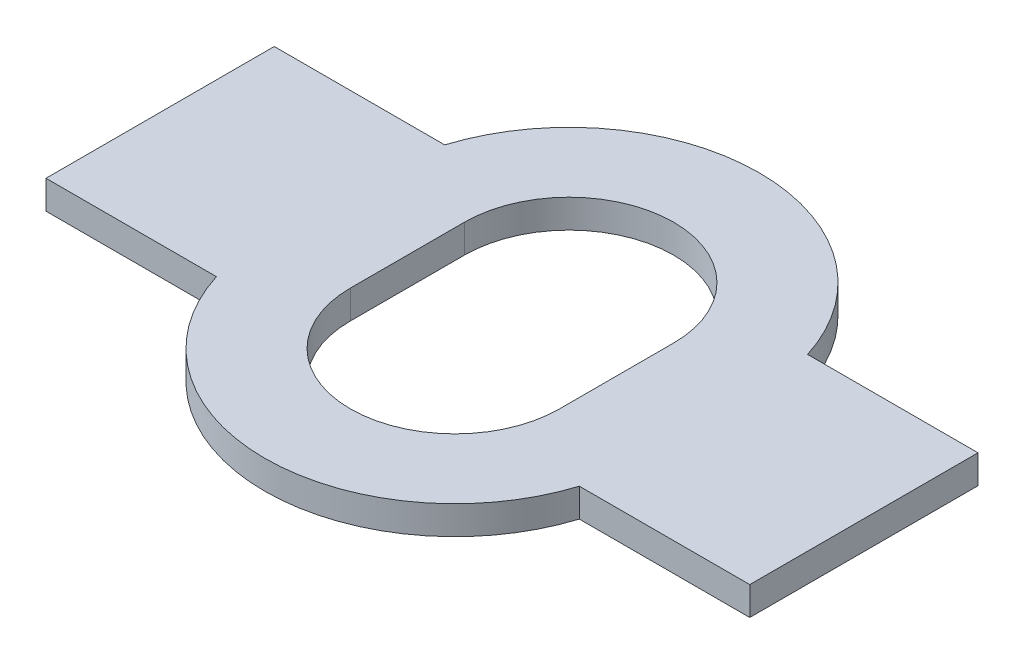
ISO-10303-21;
HEADER;
FILE_DESCRIPTION(('STEP AP214'),'2;1');
FILE_NAME('part.step','',(''),(''),'','','');
FILE_SCHEMA(('AUTOMOTIVE_DESIGN { 1 0 10303 214 1 1 1 1 }'));
ENDSEC;
DATA;
#1=APPLICATION_CONTEXT('core data for automotive mechanical design processes');
#2=APPLICATION_PROTOCOL_DEFINITION('international standard','automotive_design',2000,#1);
#3=PRODUCT_CONTEXT('',#1,'mechanical');
#4=PRODUCT('Part','Part','',(#3));
#5=PRODUCT_RELATED_PRODUCT_CATEGORY('part','',(#4));
#6=PRODUCT_DEFINITION_FORMATION('','',#4);
#7=PRODUCT_DEFINITION_CONTEXT('part definition',#1,'design');
#8=PRODUCT_DEFINITION('design','',#6,#7);
#9=PRODUCT_DEFINITION_SHAPE('','',#8);
#10=(LENGTH_UNIT() NAMED_UNIT(*) SI_UNIT(.MILLI.,.METRE.));
#11=(NAMED_UNIT(*) PLANE_ANGLE_UNIT() SI_UNIT($,.RADIAN.));
#12=(NAMED_UNIT(*) SI_UNIT($,.STERADIAN.) SOLID_ANGLE_UNIT());
#13=UNCERTAINTY_MEASURE_WITH_UNIT(LENGTH_MEASURE(1.E-05),#10,'distance_accuracy_value','');
#14=(GEOMETRIC_REPRESENTATION_CONTEXT(3) GLOBAL_UNCERTAINTY_ASSIGNED_CONTEXT((#13)) GLOBAL_UNIT_ASSIGNED_CONTEXT((#10,
#11,#12)) REPRESENTATION_CONTEXT('',''));
#15=CARTESIAN_POINT('',(0.,0.,0.));
#16=DIRECTION('',(0.,0.,1.));
#17=DIRECTION('',(1.,0.,0.));
#18=AXIS2_PLACEMENT_3D('',#15,#16,#17);
#19=CARTESIAN_POINT('',(0.,3.,-6.00000000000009));
#20=DIRECTION('',(0.,1.,0.));
#21=DIRECTION('',(0.,0.,1.));
#22=AXIS2_PLACEMENT_3D('',#19,#20,#21);
#23=PLANE('',#22);
#24=DIRECTION('',(0.,0.,-1.));
#25=VECTOR('',#24,1.);
#26=CARTESIAN_POINT('',(37.,3.,12.));
#27=LINE('',#26,#25);
#28=CARTESIAN_POINT('',(37.,3.,12.));
#29=VERTEX_POINT('',#28);
#30=CARTESIAN_POINT('',(37.,3.,-12.0000000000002));
#31=VERTEX_POINT('',#30);
#32=EDGE_CURVE('E156',#29,#31,#27,.T.);
#33=ORIENTED_EDGE('',*,*,#32,.T.);
#34=DIRECTION('',(-1.,0.,0.));
#35=VECTOR('',#34,1.);
#36=CARTESIAN_POINT('',(37.,3.,-12.0000000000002));
#37=LINE('',#36,#35);
#38=CARTESIAN_POINT('',(19.0787840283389,3.,-12.));
#39=VERTEX_POINT('',#38);
#40=EDGE_CURVE('E159',#31,#39,#37,.T.);
#41=ORIENTED_EDGE('',*,*,#40,.T.);
#42=CARTESIAN_POINT('',(0.,3.,-6.00000000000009));
#43=DIRECTION('',(0.,1.,0.));
#44=DIRECTION('',(0.,0.,1.));
#45=AXIS2_PLACEMENT_3D('',#42,#43,#44);
#46=CIRCLE('',#45,20.);
#47=CARTESIAN_POINT('',(-19.0787840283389,3.,-12.));
#48=VERTEX_POINT('',#47);
#49=EDGE_CURVE('E162',#39,#48,#46,.T.);
#50=ORIENTED_EDGE('',*,*,#49,.T.);
#51=DIRECTION('',(-1.,0.,0.));
#52=VECTOR('',#51,1.);
#53=CARTESIAN_POINT('',(-19.0787840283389,3.,-12.));
#54=LINE('',#53,#52);
#55=CARTESIAN_POINT('',(-37.,3.,-12.0000000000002));
#56=VERTEX_POINT('',#55);
#57=EDGE_CURVE('E164',#48,#56,#54,.T.);
#58=ORIENTED_EDGE('',*,*,#57,.T.);
#59=DIRECTION('',(0.,0.,1.));
#60=VECTOR('',#59,1.);
#61=CARTESIAN_POINT('',(-37.,3.,12.));
#62=LINE('',#61,#60);
#63=CARTESIAN_POINT('',(-37.,3.,12.));
#64=VERTEX_POINT('',#63);
#65=EDGE_CURVE('E166',#56,#64,#62,.T.);
#66=ORIENTED_EDGE('',*,*,#65,.T.);
#67=DIRECTION('',(1.,0.,0.));
#68=VECTOR('',#67,1.);
#69=CARTESIAN_POINT('',(-37.,3.,12.));
#70=LINE('',#69,#68);
#71=CARTESIAN_POINT('',(-19.0787840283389,3.,12.));
#72=VERTEX_POINT('',#71);
#73=EDGE_CURVE('E168',#64,#72,#70,.T.);
#74=ORIENTED_EDGE('',*,*,#73,.T.);
#75=CARTESIAN_POINT('',(0.,3.,5.99999999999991));
#76=DIRECTION('',(0.,1.,0.));
#77=DIRECTION('',(0.,0.,1.));
#78=AXIS2_PLACEMENT_3D('',#75,#76,#77);
#79=CIRCLE('',#78,20.);
#80=CARTESIAN_POINT('',(19.0787840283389,3.,12.));
#81=VERTEX_POINT('',#80);
#82=EDGE_CURVE('E170',#72,#81,#79,.T.);
#83=ORIENTED_EDGE('',*,*,#82,.T.);
#84=DIRECTION('',(1.,0.,0.));
#85=VECTOR('',#84,1.);
#86=CARTESIAN_POINT('',(19.0787840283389,3.,12.));
#87=LINE('',#86,#85);
#88=EDGE_CURVE('E172',#81,#29,#87,.T.);
#89=ORIENTED_EDGE('',*,*,#88,.T.);
#90=EDGE_LOOP('',(#33,#41,#50,#58,#66,#74,#83,#89));
#91=FACE_BOUND('',#90,.T.);
#92=DIRECTION('',(0.,0.,1.));
#93=VECTOR('',#92,1.);
#94=CARTESIAN_POINT('',(-11.,3.,-6.00000000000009));
#95=LINE('',#94,#93);
#96=CARTESIAN_POINT('',(-11.,3.,-6.00000000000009));
#97=VERTEX_POINT('',#96);
#98=CARTESIAN_POINT('',(-11.,3.,5.99999999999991));
#99=VERTEX_POINT('',#98);
#100=EDGE_CURVE('E128',#97,#99,#95,.T.);
#101=ORIENTED_EDGE('',*,*,#100,.F.);
#102=CARTESIAN_POINT('',(0.,3.,-6.00000000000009));
#103=DIRECTION('',(0.,1.,0.));
#104=DIRECTION('',(0.,0.,1.));
#105=AXIS2_PLACEMENT_3D('',#102,#103,#104);
#106=CIRCLE('',#105,11.);
#107=CARTESIAN_POINT('',(11.,3.,-6.00000000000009));
#108=VERTEX_POINT('',#107);
#109=EDGE_CURVE('E120',#108,#97,#106,.T.);
#110=ORIENTED_EDGE('',*,*,#109,.F.);
#111=DIRECTION('',(0.,0.,-1.));
#112=VECTOR('',#111,1.);
#113=CARTESIAN_POINT('',(11.,3.,-6.00000000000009));
#114=LINE('',#113,#112);
#115=CARTESIAN_POINT('',(11.,3.,5.99999999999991));
#116=VERTEX_POINT('',#115);
#117=EDGE_CURVE('E142',#116,#108,#114,.T.);
#118=ORIENTED_EDGE('',*,*,#117,.F.);
#119=CARTESIAN_POINT('',(0.,3.,5.99999999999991));
#120=DIRECTION('',(0.,1.,0.));
#121=DIRECTION('',(0.,0.,1.));
#122=AXIS2_PLACEMENT_3D('',#119,#120,#121);
#123=CIRCLE('',#122,11.);
#124=EDGE_CURVE('E140',#99,#116,#123,.T.);
#125=ORIENTED_EDGE('',*,*,#124,.F.);
#126=EDGE_LOOP('',(#101,#110,#118,#125));
#127=FACE_BOUND('',#126,.T.);
#128=ADVANCED_FACE('F31',(#91,#127),#23,.T.);
#129=CARTESIAN_POINT('',(0.,0.,-6.00000000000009));
#130=DIRECTION('',(0.,1.,0.));
#131=DIRECTION('',(0.,0.,1.));
#132=AXIS2_PLACEMENT_3D('',#129,#130,#131);
#133=PLANE('',#132);
#134=DIRECTION('',(0.,0.,-1.));
#135=VECTOR('',#134,1.);
#136=CARTESIAN_POINT('',(37.,0.,12.));
#137=LINE('',#136,#135);
#138=CARTESIAN_POINT('',(37.,0.,12.));
#139=VERTEX_POINT('',#138);
#140=CARTESIAN_POINT('',(37.,0.,-12.0000000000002));
#141=VERTEX_POINT('',#140);
#142=EDGE_CURVE('E136',#139,#141,#137,.T.);
#143=ORIENTED_EDGE('',*,*,#142,.F.);
#144=DIRECTION('',(1.,0.,0.));
#145=VECTOR('',#144,1.);
#146=CARTESIAN_POINT('',(19.0787840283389,0.,12.));
#147=LINE('',#146,#145);
#148=CARTESIAN_POINT('',(19.0787840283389,0.,12.));
#149=VERTEX_POINT('',#148);
#150=EDGE_CURVE('E160',#149,#139,#147,.T.);
#151=ORIENTED_EDGE('',*,*,#150,.F.);
#152=CARTESIAN_POINT('',(0.,0.,5.99999999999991));
#153=DIRECTION('',(0.,1.,0.));
#154=DIRECTION('',(0.,0.,1.));
#155=AXIS2_PLACEMENT_3D('',#152,#153,#154);
#156=CIRCLE('',#155,20.);
#157=CARTESIAN_POINT('',(-19.0787840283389,0.,12.));
#158=VERTEX_POINT('',#157);
#159=EDGE_CURVE('E187',#158,#149,#156,.T.);
#160=ORIENTED_EDGE('',*,*,#159,.F.);
#161=DIRECTION('',(1.,0.,0.));
#162=VECTOR('',#161,1.);
#163=CARTESIAN_POINT('',(-37.,0.,12.));
#164=LINE('',#163,#162);
#165=CARTESIAN_POINT('',(-37.,0.,12.));
#166=VERTEX_POINT('',#165);
#167=EDGE_CURVE('E185',#166,#158,#164,.T.);
#168=ORIENTED_EDGE('',*,*,#167,.F.);
#169=DIRECTION('',(0.,0.,1.));
#170=VECTOR('',#169,1.);
#171=CARTESIAN_POINT('',(-37.,0.,12.));
#172=LINE('',#171,#170);
#173=CARTESIAN_POINT('',(-37.,0.,-12.0000000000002));
#174=VERTEX_POINT('',#173);
#175=EDGE_CURVE('E183',#174,#166,#172,.T.);
#176=ORIENTED_EDGE('',*,*,#175,.F.);
#177=DIRECTION('',(-1.,0.,0.));
#178=VECTOR('',#177,1.);
#179=CARTESIAN_POINT('',(-19.0787840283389,0.,-12.));
#180=LINE('',#179,#178);
#181=CARTESIAN_POINT('',(-19.0787840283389,0.,-12.));
#182=VERTEX_POINT('',#181);
#183=EDGE_CURVE('E181',#182,#174,#180,.T.);
#184=ORIENTED_EDGE('',*,*,#183,.F.);
#185=CARTESIAN_POINT('',(0.,0.,-6.00000000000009));
#186=DIRECTION('',(0.,1.,0.));
#187=DIRECTION('',(0.,0.,1.));
#188=AXIS2_PLACEMENT_3D('',#185,#186,#187);
#189=CIRCLE('',#188,20.);
#190=CARTESIAN_POINT('',(19.0787840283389,0.,-12.));
#191=VERTEX_POINT('',#190);
#192=EDGE_CURVE('E179',#191,#182,#189,.T.);
#193=ORIENTED_EDGE('',*,*,#192,.F.);
#194=DIRECTION('',(-1.,0.,0.));
#195=VECTOR('',#194,1.);
#196=CARTESIAN_POINT('',(37.,0.,-12.0000000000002));
#197=LINE('',#196,#195);
#198=EDGE_CURVE('E177',#141,#191,#197,.T.);
#199=ORIENTED_EDGE('',*,*,#198,.F.);
#200=EDGE_LOOP('',(#143,#151,#160,#168,#176,#184,#193,#199));
#201=FACE_BOUND('',#200,.T.);
#202=CARTESIAN_POINT('',(0.,0.,-6.00000000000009));
#203=DIRECTION('',(0.,1.,0.));
#204=DIRECTION('',(0.,0.,1.));
#205=AXIS2_PLACEMENT_3D('',#202,#203,#204);
#206=CIRCLE('',#205,11.);
#207=CARTESIAN_POINT('',(11.,0.,-6.00000000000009));
#208=VERTEX_POINT('',#207);
#209=CARTESIAN_POINT('',(-11.,0.,-6.00000000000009));
#210=VERTEX_POINT('',#209);
#211=EDGE_CURVE('E54',#208,#210,#206,.T.);
#212=ORIENTED_EDGE('',*,*,#211,.T.);
#213=DIRECTION('',(0.,0.,1.));
#214=VECTOR('',#213,1.);
#215=CARTESIAN_POINT('',(-11.,0.,-6.00000000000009));
#216=LINE('',#215,#214);
#217=CARTESIAN_POINT('',(-11.,0.,5.99999999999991));
#218=VERTEX_POINT('',#217);
#219=EDGE_CURVE('E135',#210,#218,#216,.T.);
#220=ORIENTED_EDGE('',*,*,#219,.T.);
#221=CARTESIAN_POINT('',(0.,0.,5.99999999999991));
#222=DIRECTION('',(0.,1.,0.));
#223=DIRECTION('',(0.,0.,1.));
#224=AXIS2_PLACEMENT_3D('',#221,#222,#223);
#225=CIRCLE('',#224,11.);
#226=CARTESIAN_POINT('',(11.,0.,5.99999999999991));
#227=VERTEX_POINT('',#226);
#228=EDGE_CURVE('E148',#218,#227,#225,.T.);
#229=ORIENTED_EDGE('',*,*,#228,.T.);
#230=DIRECTION('',(0.,0.,-1.));
#231=VECTOR('',#230,1.);
#232=CARTESIAN_POINT('',(11.,0.,-6.00000000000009));
#233=LINE('',#232,#231);
#234=EDGE_CURVE('E129',#227,#208,#233,.T.);
#235=ORIENTED_EDGE('',*,*,#234,.T.);
#236=EDGE_LOOP('',(#212,#220,#229,#235));
#237=FACE_BOUND('',#236,.T.);
#238=ADVANCED_FACE('F217',(#201,#237),#133,.F.);
#239=CARTESIAN_POINT('',(37.,3.,12.));
#240=DIRECTION('',(-1.,0.,0.));
#241=DIRECTION('',(0.,0.,1.));
#242=AXIS2_PLACEMENT_3D('',#239,#240,#241);
#243=PLANE('',#242);
#244=ORIENTED_EDGE('',*,*,#142,.T.);
#245=DIRECTION('',(0.,-1.,0.));
#246=VECTOR('',#245,1.);
#247=CARTESIAN_POINT('',(37.,3.,-12.0000000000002));
#248=LINE('',#247,#246);
#249=EDGE_CURVE('E11',#31,#141,#248,.T.);
#250=ORIENTED_EDGE('',*,*,#249,.F.);
#251=ORIENTED_EDGE('',*,*,#32,.F.);
#252=DIRECTION('',(0.,-1.,0.));
#253=VECTOR('',#252,1.);
#254=CARTESIAN_POINT('',(37.,3.,12.));
#255=LINE('',#254,#253);
#256=EDGE_CURVE('E174',#29,#139,#255,.T.);
#257=ORIENTED_EDGE('',*,*,#256,.T.);
#258=EDGE_LOOP('',(#244,#250,#251,#257));
#259=FACE_BOUND('',#258,.T.);
#260=ADVANCED_FACE('F33',(#259),#243,.F.);
#261=CARTESIAN_POINT('',(37.,3.,-12.0000000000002));
#262=DIRECTION('',(0.,0.,1.));
#263=DIRECTION('',(1.,0.,0.));
#264=AXIS2_PLACEMENT_3D('',#261,#262,#263);
#265=PLANE('',#264);
#266=ORIENTED_EDGE('',*,*,#198,.T.);
#267=DIRECTION('',(0.,-1.,0.));
#268=VECTOR('',#267,1.);
#269=CARTESIAN_POINT('',(19.0787840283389,3.,-12.));
#270=LINE('',#269,#268);
#271=EDGE_CURVE('E39',#39,#191,#270,.T.);
#272=ORIENTED_EDGE('',*,*,#271,.F.);
#273=ORIENTED_EDGE('',*,*,#40,.F.);
#274=ORIENTED_EDGE('',*,*,#249,.T.);
#275=EDGE_LOOP('',(#266,#272,#273,#274));
#276=FACE_BOUND('',#275,.T.);
#277=ADVANCED_FACE('F234',(#276),#265,.F.);
#278=CARTESIAN_POINT('',(0.,3.,-6.00000000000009));
#279=DIRECTION('',(0.,-1.,0.));
#280=DIRECTION('',(0.,0.,-1.));
#281=AXIS2_PLACEMENT_3D('',#278,#279,#280);
#282=CYLINDRICAL_SURFACE('',#281,20.);
#283=ORIENTED_EDGE('',*,*,#192,.T.);
#284=DIRECTION('',(0.,-1.,0.));
#285=VECTOR('',#284,1.);
#286=CARTESIAN_POINT('',(-19.0787840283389,3.,-12.));
#287=LINE('',#286,#285);
#288=EDGE_CURVE('E204',#48,#182,#287,.T.);
#289=ORIENTED_EDGE('',*,*,#288,.F.);
#290=ORIENTED_EDGE('',*,*,#49,.F.);
#291=ORIENTED_EDGE('',*,*,#271,.T.);
#292=EDGE_LOOP('',(#283,#289,#290,#291));
#293=FACE_BOUND('',#292,.T.);
#294=ADVANCED_FACE('F211',(#293),#282,.T.);
#295=CARTESIAN_POINT('',(-19.0787840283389,3.,-12.));
#296=DIRECTION('',(0.,0.,1.));
#297=DIRECTION('',(1.,0.,0.));
#298=AXIS2_PLACEMENT_3D('',#295,#296,#297);
#299=PLANE('',#298);
#300=ORIENTED_EDGE('',*,*,#183,.T.);
#301=DIRECTION('',(0.,-1.,0.));
#302=VECTOR('',#301,1.);
#303=CARTESIAN_POINT('',(-37.,3.,-12.0000000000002));
#304=LINE('',#303,#302);
#305=EDGE_CURVE('E201',#56,#174,#304,.T.);
#306=ORIENTED_EDGE('',*,*,#305,.F.);
#307=ORIENTED_EDGE('',*,*,#57,.F.);
#308=ORIENTED_EDGE('',*,*,#288,.T.);
#309=EDGE_LOOP('',(#300,#306,#307,#308));
#310=FACE_BOUND('',#309,.T.);
#311=ADVANCED_FACE('F223',(#310),#299,.F.);
#312=CARTESIAN_POINT('',(-37.,3.,12.));
#313=DIRECTION('',(1.,0.,0.));
#314=DIRECTION('',(0.,0.,-1.));
#315=AXIS2_PLACEMENT_3D('',#312,#313,#314);
#316=PLANE('',#315);
#317=ORIENTED_EDGE('',*,*,#175,.T.);
#318=DIRECTION('',(0.,-1.,0.));
#319=VECTOR('',#318,1.);
#320=CARTESIAN_POINT('',(-37.,3.,12.));
#321=LINE('',#320,#319);
#322=EDGE_CURVE('E198',#64,#166,#321,.T.);
#323=ORIENTED_EDGE('',*,*,#322,.F.);
#324=ORIENTED_EDGE('',*,*,#65,.F.);
#325=ORIENTED_EDGE('',*,*,#305,.T.);
#326=EDGE_LOOP('',(#317,#323,#324,#325));
#327=FACE_BOUND('',#326,.T.);
#328=ADVANCED_FACE('F227',(#327),#316,.F.);
#329=CARTESIAN_POINT('',(-37.,3.,12.));
#330=DIRECTION('',(0.,0.,-1.));
#331=DIRECTION('',(-1.,0.,0.));
#332=AXIS2_PLACEMENT_3D('',#329,#330,#331);
#333=PLANE('',#332);
#334=ORIENTED_EDGE('',*,*,#167,.T.);
#335=DIRECTION('',(0.,-1.,0.));
#336=VECTOR('',#335,1.);
#337=CARTESIAN_POINT('',(-19.0787840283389,3.,12.));
#338=LINE('',#337,#336);
#339=EDGE_CURVE('E195',#72,#158,#338,.T.);
#340=ORIENTED_EDGE('',*,*,#339,.F.);
#341=ORIENTED_EDGE('',*,*,#73,.F.);
#342=ORIENTED_EDGE('',*,*,#322,.T.);
#343=EDGE_LOOP('',(#334,#340,#341,#342));
#344=FACE_BOUND('',#343,.T.);
#345=ADVANCED_FACE('F247',(#344),#333,.F.);
#346=CARTESIAN_POINT('',(0.,3.,5.99999999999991));
#347=DIRECTION('',(0.,-1.,0.));
#348=DIRECTION('',(0.,0.,-1.));
#349=AXIS2_PLACEMENT_3D('',#346,#347,#348);
#350=CYLINDRICAL_SURFACE('',#349,20.);
#351=ORIENTED_EDGE('',*,*,#159,.T.);
#352=DIRECTION('',(0.,-1.,0.));
#353=VECTOR('',#352,1.);
#354=CARTESIAN_POINT('',(19.0787840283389,3.,12.));
#355=LINE('',#354,#353);
#356=EDGE_CURVE('E192',#81,#149,#355,.T.);
#357=ORIENTED_EDGE('',*,*,#356,.F.);
#358=ORIENTED_EDGE('',*,*,#82,.F.);
#359=ORIENTED_EDGE('',*,*,#339,.T.);
#360=EDGE_LOOP('',(#351,#357,#358,#359));
#361=FACE_BOUND('',#360,.T.);
#362=ADVANCED_FACE('F245',(#361),#350,.T.);
#363=CARTESIAN_POINT('',(19.0787840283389,3.,12.));
#364=DIRECTION('',(0.,0.,-1.));
#365=DIRECTION('',(-1.,0.,0.));
#366=AXIS2_PLACEMENT_3D('',#363,#364,#365);
#367=PLANE('',#366);
#368=ORIENTED_EDGE('',*,*,#150,.T.);
#369=ORIENTED_EDGE('',*,*,#256,.F.);
#370=ORIENTED_EDGE('',*,*,#88,.F.);
#371=ORIENTED_EDGE('',*,*,#356,.T.);
#372=EDGE_LOOP('',(#368,#369,#370,#371));
#373=FACE_BOUND('',#372,.T.);
#374=ADVANCED_FACE('F240',(#373),#367,.F.);
#375=CARTESIAN_POINT('',(0.,3.,-6.00000000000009));
#376=DIRECTION('',(0.,-1.,0.));
#377=DIRECTION('',(0.,0.,-1.));
#378=AXIS2_PLACEMENT_3D('',#375,#376,#377);
#379=CYLINDRICAL_SURFACE('',#378,11.);
#380=ORIENTED_EDGE('',*,*,#211,.F.);
#381=DIRECTION('',(0.,-1.,0.));
#382=VECTOR('',#381,1.);
#383=CARTESIAN_POINT('',(11.,3.,-6.00000000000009));
#384=LINE('',#383,#382);
#385=EDGE_CURVE('E124',#108,#208,#384,.T.);
#386=ORIENTED_EDGE('',*,*,#385,.F.);
#387=ORIENTED_EDGE('',*,*,#109,.T.);
#388=DIRECTION('',(0.,-1.,0.));
#389=VECTOR('',#388,1.);
#390=CARTESIAN_POINT('',(-11.,3.,-6.00000000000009));
#391=LINE('',#390,#389);
#392=EDGE_CURVE('E123',#97,#210,#391,.T.);
#393=ORIENTED_EDGE('',*,*,#392,.T.);
#394=EDGE_LOOP('',(#380,#386,#387,#393));
#395=FACE_BOUND('',#394,.T.);
#396=ADVANCED_FACE('F122',(#395),#379,.F.);
#397=CARTESIAN_POINT('',(-11.,3.,-6.00000000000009));
#398=DIRECTION('',(1.,0.,0.));
#399=DIRECTION('',(0.,0.,-1.));
#400=AXIS2_PLACEMENT_3D('',#397,#398,#399);
#401=PLANE('',#400);
#402=ORIENTED_EDGE('',*,*,#219,.F.);
#403=ORIENTED_EDGE('',*,*,#392,.F.);
#404=ORIENTED_EDGE('',*,*,#100,.T.);
#405=DIRECTION('',(0.,-1.,0.));
#406=VECTOR('',#405,1.);
#407=CARTESIAN_POINT('',(-11.,3.,5.99999999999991));
#408=LINE('',#407,#406);
#409=EDGE_CURVE('E137',#99,#218,#408,.T.);
#410=ORIENTED_EDGE('',*,*,#409,.T.);
#411=EDGE_LOOP('',(#402,#403,#404,#410));
#412=FACE_BOUND('',#411,.T.);
#413=ADVANCED_FACE('F132',(#412),#401,.T.);
#414=CARTESIAN_POINT('',(0.,3.,5.99999999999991));
#415=DIRECTION('',(0.,-1.,0.));
#416=DIRECTION('',(0.,0.,-1.));
#417=AXIS2_PLACEMENT_3D('',#414,#415,#416);
#418=CYLINDRICAL_SURFACE('',#417,11.);
#419=ORIENTED_EDGE('',*,*,#228,.F.);
#420=ORIENTED_EDGE('',*,*,#409,.F.);
#421=ORIENTED_EDGE('',*,*,#124,.T.);
#422=DIRECTION('',(0.,-1.,0.));
#423=VECTOR('',#422,1.);
#424=CARTESIAN_POINT('',(11.,3.,5.99999999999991));
#425=LINE('',#424,#423);
#426=EDGE_CURVE('E46',#116,#227,#425,.T.);
#427=ORIENTED_EDGE('',*,*,#426,.T.);
#428=EDGE_LOOP('',(#419,#420,#421,#427));
#429=FACE_BOUND('',#428,.T.);
#430=ADVANCED_FACE('F272',(#429),#418,.F.);
#431=CARTESIAN_POINT('',(11.,3.,-6.00000000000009));
#432=DIRECTION('',(-1.,0.,0.));
#433=DIRECTION('',(0.,0.,1.));
#434=AXIS2_PLACEMENT_3D('',#431,#432,#433);
#435=PLANE('',#434);
#436=ORIENTED_EDGE('',*,*,#234,.F.);
#437=ORIENTED_EDGE('',*,*,#426,.F.);
#438=ORIENTED_EDGE('',*,*,#117,.T.);
#439=ORIENTED_EDGE('',*,*,#385,.T.);
#440=EDGE_LOOP('',(#436,#437,#438,#439));
#441=FACE_BOUND('',#440,.T.);
#442=ADVANCED_FACE('F276',(#441),#435,.T.);
#443=CLOSED_SHELL('',(#128,#238,#260,#277,#294,#311,#328,#345,#362,#374,#396,#413,#430,#442));
#444=MANIFOLD_SOLID_BREP('B2',#443);
#445=ADVANCED_BREP_SHAPE_REPRESENTATION('',(#18,#444),#14);
#446=SHAPE_DEFINITION_REPRESENTATION(#9,#445);
ENDSEC;
END-ISO-10303-21;
